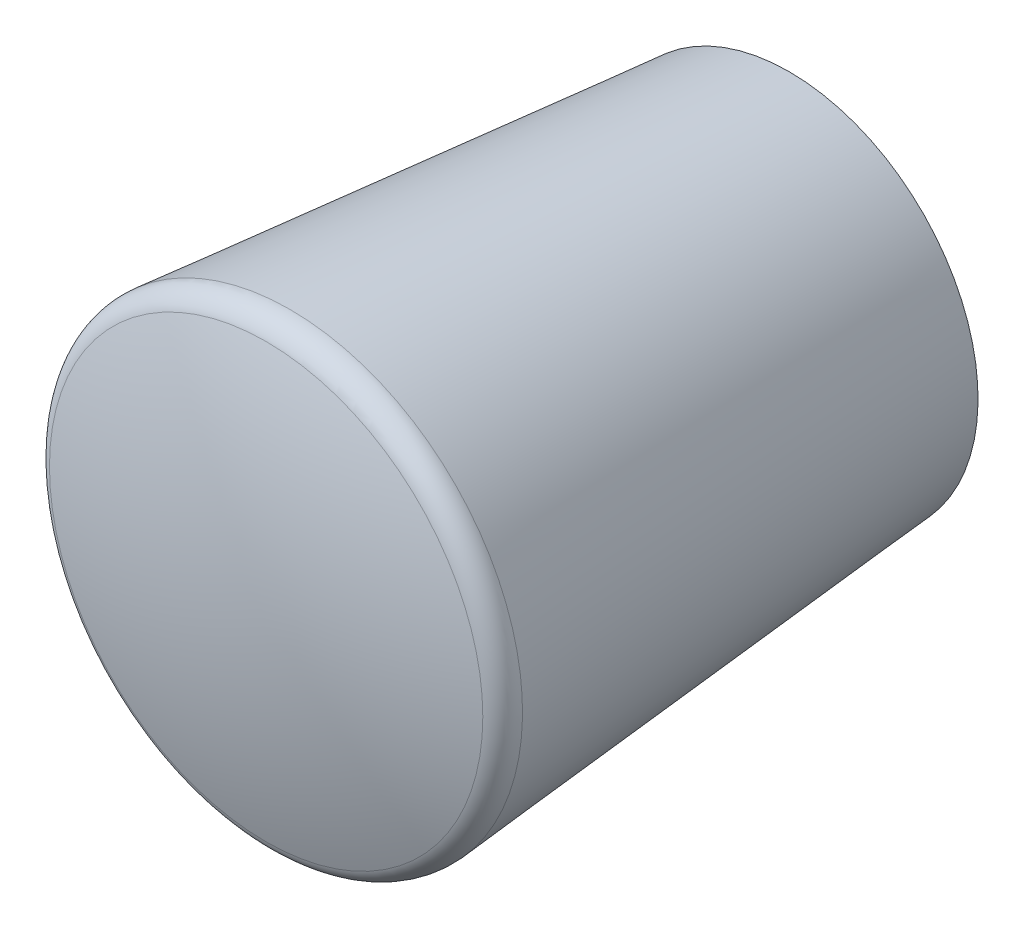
ISO-10303-21;
HEADER;
FILE_DESCRIPTION(('STEP AP214'),'2;1');
FILE_NAME('part.step','',(''),(''),'','','');
FILE_SCHEMA(('AUTOMOTIVE_DESIGN { 1 0 10303 214 1 1 1 1 }'));
ENDSEC;
DATA;
#1=APPLICATION_CONTEXT('core data for automotive mechanical design processes');
#2=APPLICATION_PROTOCOL_DEFINITION('international standard','automotive_design',2000,#1);
#3=PRODUCT_CONTEXT('',#1,'mechanical');
#4=PRODUCT('Part','Part','',(#3));
#5=PRODUCT_RELATED_PRODUCT_CATEGORY('part','',(#4));
#6=PRODUCT_DEFINITION_FORMATION('','',#4);
#7=PRODUCT_DEFINITION_CONTEXT('part definition',#1,'design');
#8=PRODUCT_DEFINITION('design','',#6,#7);
#9=PRODUCT_DEFINITION_SHAPE('','',#8);
#10=(LENGTH_UNIT() NAMED_UNIT(*) SI_UNIT(.MILLI.,.METRE.));
#11=(NAMED_UNIT(*) PLANE_ANGLE_UNIT() SI_UNIT($,.RADIAN.));
#12=(NAMED_UNIT(*) SI_UNIT($,.STERADIAN.) SOLID_ANGLE_UNIT());
#13=UNCERTAINTY_MEASURE_WITH_UNIT(LENGTH_MEASURE(1.E-05),#10,'distance_accuracy_value','');
#14=(GEOMETRIC_REPRESENTATION_CONTEXT(3) GLOBAL_UNCERTAINTY_ASSIGNED_CONTEXT((#13)) GLOBAL_UNIT_ASSIGNED_CONTEXT((#10,
#11,#12)) REPRESENTATION_CONTEXT('',''));
#15=CARTESIAN_POINT('',(0.,0.,0.));
#16=DIRECTION('',(0.,0.,1.));
#17=DIRECTION('',(1.,0.,0.));
#18=AXIS2_PLACEMENT_3D('',#15,#16,#17);
#19=CARTESIAN_POINT('',(3.,0.,16.));
#20=DIRECTION('',(0.,0.,-1.));
#21=DIRECTION('',(0.,1.,0.));
#22=AXIS2_PLACEMENT_3D('',#19,#20,#21);
#23=PLANE('',#22);
#24=CARTESIAN_POINT('',(0.,0.,16.));
#25=DIRECTION('',(0.,0.,-1.));
#26=DIRECTION('',(0.,1.,0.));
#27=AXIS2_PLACEMENT_3D('',#24,#25,#26);
#28=CIRCLE('',#27,3.);
#29=CARTESIAN_POINT('',(0.,3.,16.));
#30=VERTEX_POINT('',#29);
#31=EDGE_CURVE('E8',#30,#30,#28,.T.);
#32=ORIENTED_EDGE('',*,*,#31,.T.);
#33=EDGE_LOOP('',(#32));
#34=FACE_BOUND('',#33,.T.);
#35=ADVANCED_FACE('F12',(#34),#23,.T.);
#36=CARTESIAN_POINT('',(0.,0.,0.));
#37=DIRECTION('',(0.,0.,-1.));
#38=DIRECTION('',(0.,1.,0.));
#39=AXIS2_PLACEMENT_3D('',#36,#37,#38);
#40=CYLINDRICAL_SURFACE('',#39,3.);
#41=CARTESIAN_POINT('',(0.,0.,0.));
#42=DIRECTION('',(0.,0.,-1.));
#43=DIRECTION('',(0.,1.,0.));
#44=AXIS2_PLACEMENT_3D('',#41,#42,#43);
#45=CIRCLE('',#44,3.);
#46=CARTESIAN_POINT('',(0.,3.,0.));
#47=VERTEX_POINT('',#46);
#48=EDGE_CURVE('E18',#47,#47,#45,.T.);
#49=ORIENTED_EDGE('',*,*,#48,.T.);
#50=EDGE_LOOP('',(#49));
#51=FACE_BOUND('',#50,.T.);
#52=ORIENTED_EDGE('',*,*,#31,.F.);
#53=EDGE_LOOP('',(#52));
#54=FACE_BOUND('',#53,.T.);
#55=ADVANCED_FACE('F52',(#51,#54),#40,.F.);
#56=CARTESIAN_POINT('',(3.,0.,0.));
#57=DIRECTION('',(0.,0.,-1.));
#58=DIRECTION('',(0.,1.,0.));
#59=AXIS2_PLACEMENT_3D('',#56,#57,#58);
#60=PLANE('',#59);
#61=CARTESIAN_POINT('',(0.,0.,0.));
#62=DIRECTION('',(0.,0.,-1.));
#63=DIRECTION('',(0.,1.,0.));
#64=AXIS2_PLACEMENT_3D('',#61,#62,#63);
#65=CIRCLE('',#64,5.);
#66=CARTESIAN_POINT('',(0.,5.,0.));
#67=VERTEX_POINT('',#66);
#68=EDGE_CURVE('E22',#67,#67,#65,.T.);
#69=ORIENTED_EDGE('',*,*,#68,.T.);
#70=EDGE_LOOP('',(#69));
#71=FACE_BOUND('',#70,.T.);
#72=ORIENTED_EDGE('',*,*,#48,.F.);
#73=EDGE_LOOP('',(#72));
#74=FACE_BOUND('',#73,.T.);
#75=ADVANCED_FACE('F57',(#71,#74),#60,.T.);
#76=CARTESIAN_POINT('',(0.,0.,0.));
#77=DIRECTION('',(0.,0.,1.));
#78=DIRECTION('',(0.,-1.,0.));
#79=AXIS2_PLACEMENT_3D('',#76,#77,#78);
#80=CONICAL_SURFACE('',#79,5.,1.0471975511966);
#81=CARTESIAN_POINT('',(0.,0.,1.83443525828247));
#82=DIRECTION('',(0.,0.,-1.));
#83=DIRECTION('',(0.,1.,0.));
#84=AXIS2_PLACEMENT_3D('',#81,#82,#83);
#85=CIRCLE('',#84,8.17733507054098);
#86=CARTESIAN_POINT('',(0.,8.17733507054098,1.83443525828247));
#87=VERTEX_POINT('',#86);
#88=EDGE_CURVE('E26',#87,#87,#85,.T.);
#89=ORIENTED_EDGE('',*,*,#88,.T.);
#90=EDGE_LOOP('',(#89));
#91=FACE_BOUND('',#90,.T.);
#92=ORIENTED_EDGE('',*,*,#68,.F.);
#93=EDGE_LOOP('',(#92));
#94=FACE_BOUND('',#93,.T.);
#95=ADVANCED_FACE('F62',(#91,#94),#80,.T.);
#96=CARTESIAN_POINT('',(0.,0.,1.83443525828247));
#97=DIRECTION('',(0.,0.,1.));
#98=DIRECTION('',(0.,-1.,0.));
#99=AXIS2_PLACEMENT_3D('',#96,#97,#98);
#100=CONICAL_SURFACE('',#99,8.17733507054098,0.0872664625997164);
#101=CARTESIAN_POINT('',(0.,0.,23.457044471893));
#102=DIRECTION('',(0.,0.,-1.));
#103=DIRECTION('',(0.,1.,0.));
#104=AXIS2_PLACEMENT_3D('',#101,#102,#103);
#105=CIRCLE('',#104,10.0690682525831);
#106=CARTESIAN_POINT('',(0.,10.0690682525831,23.457044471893));
#107=VERTEX_POINT('',#106);
#108=EDGE_CURVE('E31',#107,#107,#105,.T.);
#109=ORIENTED_EDGE('',*,*,#108,.T.);
#110=EDGE_LOOP('',(#109));
#111=FACE_BOUND('',#110,.T.);
#112=ORIENTED_EDGE('',*,*,#88,.F.);
#113=EDGE_LOOP('',(#112));
#114=FACE_BOUND('',#113,.T.);
#115=ADVANCED_FACE('F49',(#111,#114),#100,.T.);
#116=CARTESIAN_POINT('',(0.,0.,23.5442002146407));
#117=DIRECTION('',(0.,0.,-1.));
#118=DIRECTION('',(0.,1.,0.));
#119=AXIS2_PLACEMENT_3D('',#116,#117,#118);
#120=TOROIDAL_SURFACE('',#119,9.07287355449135,1.);
#121=CARTESIAN_POINT('',(0.,0.,24.4940002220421));
#122=DIRECTION('',(0.,0.,-1.));
#123=DIRECTION('',(0.,1.,0.));
#124=AXIS2_PLACEMENT_3D('',#121,#122,#123);
#125=CIRCLE('',#124,9.38573126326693);
#126=CARTESIAN_POINT('',(0.,9.38573126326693,24.4940002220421));
#127=VERTEX_POINT('',#126);
#128=EDGE_CURVE('E34',#127,#127,#125,.T.);
#129=ORIENTED_EDGE('',*,*,#128,.T.);
#130=EDGE_LOOP('',(#129));
#131=FACE_BOUND('',#130,.T.);
#132=ORIENTED_EDGE('',*,*,#108,.F.);
#133=EDGE_LOOP('',(#132));
#134=FACE_BOUND('',#133,.T.);
#135=ADVANCED_FACE('F38',(#131,#134),#120,.T.);
#136=CARTESIAN_POINT('',(0.,0.,-4.));
#137=DIRECTION('',(0.,0.,-1.));
#138=DIRECTION('',(1.,0.,0.));
#139=AXIS2_PLACEMENT_3D('',#136,#137,#138);
#140=SPHERICAL_SURFACE('',#139,30.);
#141=ORIENTED_EDGE('',*,*,#128,.F.);
#142=EDGE_LOOP('',(#141));
#143=FACE_BOUND('',#142,.T.);
#144=ADVANCED_FACE('F41',(#143),#140,.T.);
#145=CLOSED_SHELL('',(#35,#55,#75,#95,#115,#135,#144));
#146=MANIFOLD_SOLID_BREP('B1',#145);
#147=ADVANCED_BREP_SHAPE_REPRESENTATION('',(#18,#146),#14);
#148=SHAPE_DEFINITION_REPRESENTATION(#9,#147);
ENDSEC;
END-ISO-10303-21;
